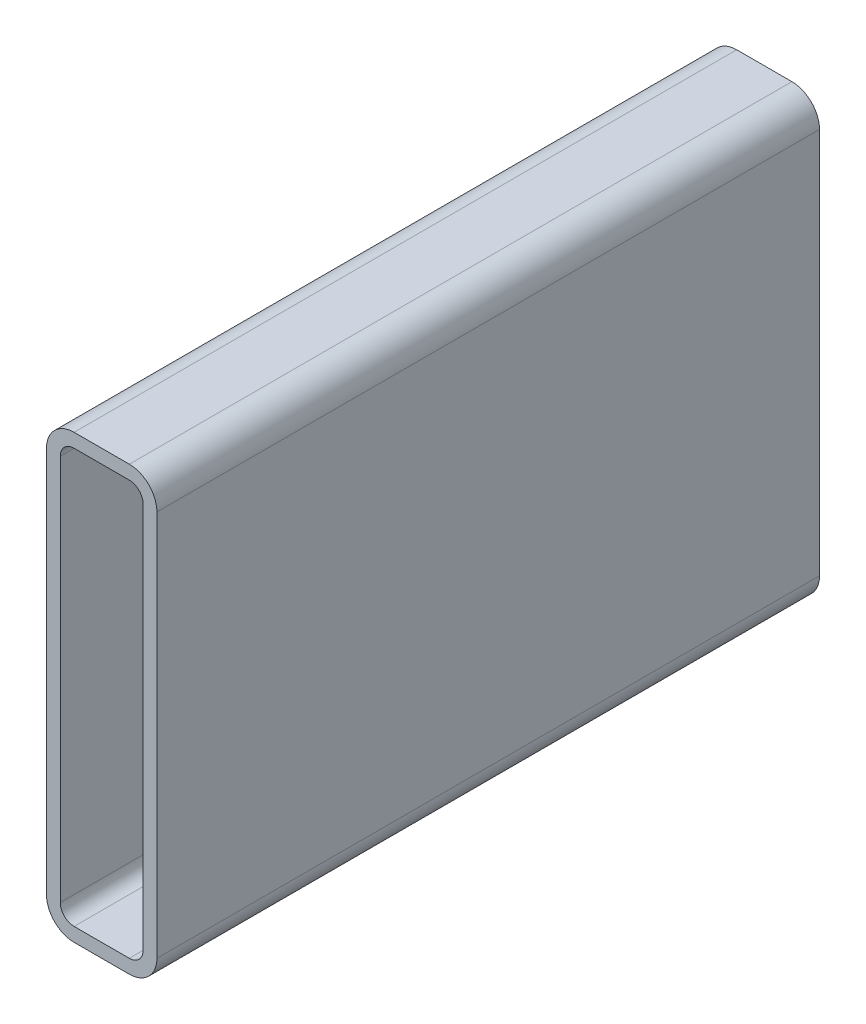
from build123d import *

# Parameters (mm, degrees)
BOSS_EXTRUDE1_DEPTH = 304.8


with BuildPart() as part:
    # Sketch1 → Boss-Extrude1 (new body)
    with BuildSketch(Plane.XY):
        with BuildLine():
            Line((12.7, 203.2), (38.1, 203.2))
            ThreePointArc((38.1, 203.2), (47.080256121, 199.480256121), (50.8, 190.5))
            Line((50.8, 190.5), (50.8, 12.7))
            ThreePointArc((50.8, 12.7), (47.080256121, 3.719743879), (38.1, 0))
            Line((38.1, 0), (12.7, 0))
            ThreePointArc((12.7, 0), (3.719743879, 3.719743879), (0, 12.7))
            Line((0, 12.7), (0, 190.5))
            ThreePointArc((0, 190.5), (3.719743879, 199.480256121), (12.7, 203.2))
        make_face()
        with BuildLine():
            Line((12.7, 196.85), (38.1, 196.85))
            ThreePointArc((38.1, 196.85), (42.590128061, 194.990128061), (44.45, 190.5))
            Line((44.45, 190.5), (44.45, 12.7))
            ThreePointArc((44.45, 12.7), (42.590128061, 8.209871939), (38.1, 6.35))
            Line((38.1, 6.35), (12.7, 6.35))
            ThreePointArc((12.7, 6.35), (8.209871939, 8.209871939), (6.35, 12.7))
            Line((6.35, 12.7), (6.35, 190.5))
            ThreePointArc((6.35, 190.5), (8.209871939, 194.990128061), (12.7, 196.85))
        make_face(mode=Mode.SUBTRACT)
    extrude(amount=BOSS_EXTRUDE1_DEPTH)


solid = part.part
